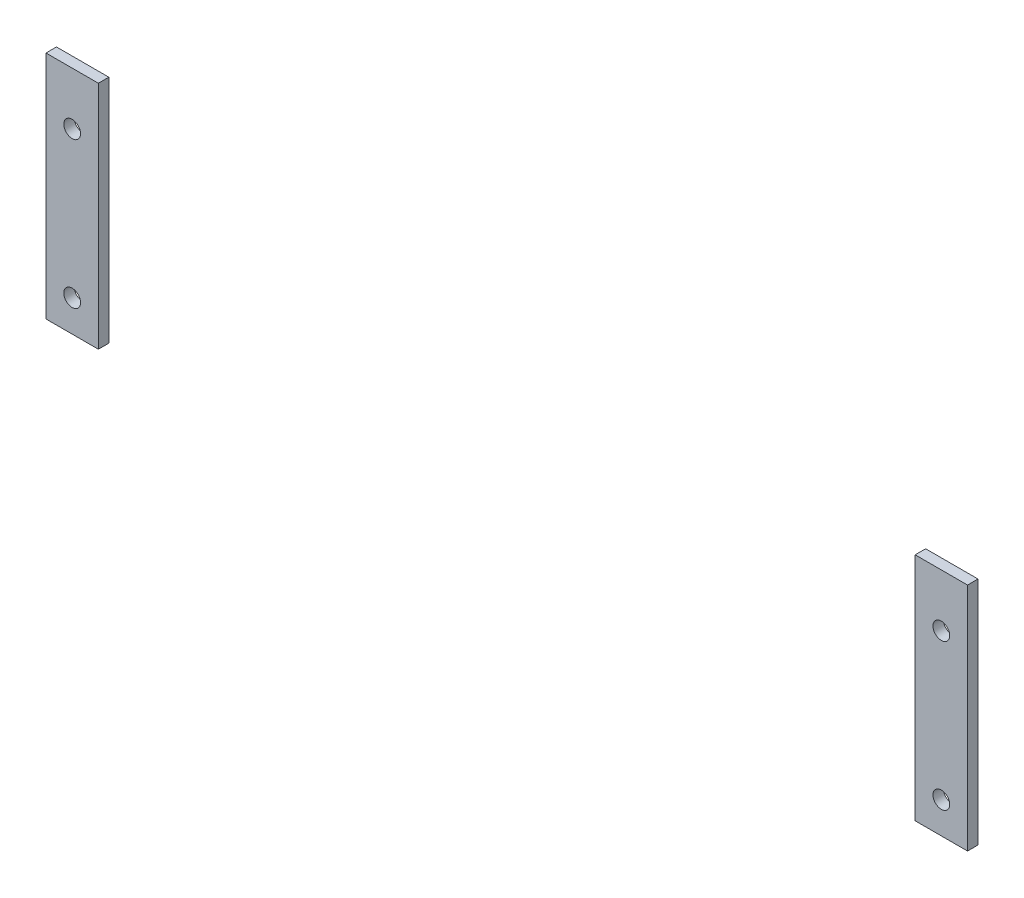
ISO-10303-21;
HEADER;
FILE_DESCRIPTION(('STEP AP214'),'2;1');
FILE_NAME('part.step','',(''),(''),'','','');
FILE_SCHEMA(('AUTOMOTIVE_DESIGN { 1 0 10303 214 1 1 1 1 }'));
ENDSEC;
DATA;
#1=APPLICATION_CONTEXT('core data for automotive mechanical design processes');
#2=APPLICATION_PROTOCOL_DEFINITION('international standard','automotive_design',2000,#1);
#3=PRODUCT_CONTEXT('',#1,'mechanical');
#4=PRODUCT('Part','Part','',(#3));
#5=PRODUCT_RELATED_PRODUCT_CATEGORY('part','',(#4));
#6=PRODUCT_DEFINITION_FORMATION('','',#4);
#7=PRODUCT_DEFINITION_CONTEXT('part definition',#1,'design');
#8=PRODUCT_DEFINITION('design','',#6,#7);
#9=PRODUCT_DEFINITION_SHAPE('','',#8);
#10=(LENGTH_UNIT() NAMED_UNIT(*) SI_UNIT(.MILLI.,.METRE.));
#11=(NAMED_UNIT(*) PLANE_ANGLE_UNIT() SI_UNIT($,.RADIAN.));
#12=(NAMED_UNIT(*) SI_UNIT($,.STERADIAN.) SOLID_ANGLE_UNIT());
#13=UNCERTAINTY_MEASURE_WITH_UNIT(LENGTH_MEASURE(1.E-05),#10,'distance_accuracy_value','');
#14=(GEOMETRIC_REPRESENTATION_CONTEXT(3) GLOBAL_UNCERTAINTY_ASSIGNED_CONTEXT((#13)) GLOBAL_UNIT_ASSIGNED_CONTEXT((#10,
#11,#12)) REPRESENTATION_CONTEXT('',''));
#15=CARTESIAN_POINT('',(0.,0.,0.));
#16=DIRECTION('',(0.,0.,1.));
#17=DIRECTION('',(1.,0.,0.));
#18=AXIS2_PLACEMENT_3D('',#15,#16,#17);
#19=CARTESIAN_POINT('',(3022.000074,-1631.829977,-1.00000000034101E-05));
#20=DIRECTION('',(1.,0.,0.));
#21=DIRECTION('',(0.,0.,-1.));
#22=AXIS2_PLACEMENT_3D('',#19,#20,#21);
#23=PLANE('',#22);
#24=DIRECTION('',(0.,1.,0.));
#25=VECTOR('',#24,1.);
#26=CARTESIAN_POINT('',(3022.000074,-1631.829977,9.99999));
#27=LINE('',#26,#25);
#28=CARTESIAN_POINT('',(3022.000074,-1631.829977,9.99999));
#29=VERTEX_POINT('',#28);
#30=CARTESIAN_POINT('',(3022.000074,-1411.829948,9.99999));
#31=VERTEX_POINT('',#30);
#32=EDGE_CURVE('E112',#29,#31,#27,.T.);
#33=ORIENTED_EDGE('',*,*,#32,.F.);
#34=DIRECTION('',(0.,0.,1.));
#35=VECTOR('',#34,1.);
#36=CARTESIAN_POINT('',(3022.000074,-1631.829977,-1.00000000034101E-05));
#37=LINE('',#36,#35);
#38=CARTESIAN_POINT('',(3022.000074,-1631.829977,-1.00000000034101E-05));
#39=VERTEX_POINT('',#38);
#40=EDGE_CURVE('E12',#39,#29,#37,.T.);
#41=ORIENTED_EDGE('',*,*,#40,.F.);
#42=DIRECTION('',(0.,1.,0.));
#43=VECTOR('',#42,1.);
#44=CARTESIAN_POINT('',(3022.000074,-1631.829977,-1.00000000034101E-05));
#45=LINE('',#44,#43);
#46=CARTESIAN_POINT('',(3022.000074,-1411.829948,-1.00000000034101E-05));
#47=VERTEX_POINT('',#46);
#48=EDGE_CURVE('E105',#39,#47,#45,.T.);
#49=ORIENTED_EDGE('',*,*,#48,.T.);
#50=DIRECTION('',(0.,0.,1.));
#51=VECTOR('',#50,1.);
#52=CARTESIAN_POINT('',(3022.000074,-1411.829948,-1.00000000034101E-05));
#53=LINE('',#52,#51);
#54=EDGE_CURVE('E50',#47,#31,#53,.T.);
#55=ORIENTED_EDGE('',*,*,#54,.T.);
#56=EDGE_LOOP('',(#33,#41,#49,#55));
#57=FACE_BOUND('',#56,.T.);
#58=ADVANCED_FACE('F47',(#57),#23,.T.);
#59=CARTESIAN_POINT('',(2972.000122,-1631.829977,-1.00000000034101E-05));
#60=DIRECTION('',(0.,-1.,0.));
#61=DIRECTION('',(0.,0.,-1.));
#62=AXIS2_PLACEMENT_3D('',#59,#60,#61);
#63=PLANE('',#62);
#64=DIRECTION('',(1.,0.,0.));
#65=VECTOR('',#64,1.);
#66=CARTESIAN_POINT('',(2972.000122,-1631.829977,9.99999));
#67=LINE('',#66,#65);
#68=CARTESIAN_POINT('',(2972.000122,-1631.829977,9.99999));
#69=VERTEX_POINT('',#68);
#70=EDGE_CURVE('E107',#69,#29,#67,.T.);
#71=ORIENTED_EDGE('',*,*,#70,.F.);
#72=DIRECTION('',(0.,0.,1.));
#73=VECTOR('',#72,1.);
#74=CARTESIAN_POINT('',(2972.000122,-1631.829977,-1.00000000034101E-05));
#75=LINE('',#74,#73);
#76=CARTESIAN_POINT('',(2972.000122,-1631.829977,-1.00000000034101E-05));
#77=VERTEX_POINT('',#76);
#78=EDGE_CURVE('E56',#77,#69,#75,.T.);
#79=ORIENTED_EDGE('',*,*,#78,.F.);
#80=DIRECTION('',(1.,0.,0.));
#81=VECTOR('',#80,1.);
#82=CARTESIAN_POINT('',(2972.000122,-1631.829977,-1.00000000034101E-05));
#83=LINE('',#82,#81);
#84=EDGE_CURVE('E102',#77,#39,#83,.T.);
#85=ORIENTED_EDGE('',*,*,#84,.T.);
#86=ORIENTED_EDGE('',*,*,#40,.T.);
#87=EDGE_LOOP('',(#71,#79,#85,#86));
#88=FACE_BOUND('',#87,.T.);
#89=ADVANCED_FACE('F123',(#88),#63,.T.);
#90=CARTESIAN_POINT('',(2972.000122,-1411.829948,-1.00000000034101E-05));
#91=DIRECTION('',(-1.,0.,0.));
#92=DIRECTION('',(0.,0.,1.));
#93=AXIS2_PLACEMENT_3D('',#90,#91,#92);
#94=PLANE('',#93);
#95=DIRECTION('',(0.,-1.,0.));
#96=VECTOR('',#95,1.);
#97=CARTESIAN_POINT('',(2972.000122,-1411.829948,9.99999));
#98=LINE('',#97,#96);
#99=CARTESIAN_POINT('',(2972.000122,-1411.829948,9.99999));
#100=VERTEX_POINT('',#99);
#101=EDGE_CURVE('E97',#100,#69,#98,.T.);
#102=ORIENTED_EDGE('',*,*,#101,.F.);
#103=DIRECTION('',(0.,0.,1.));
#104=VECTOR('',#103,1.);
#105=CARTESIAN_POINT('',(2972.000122,-1411.829948,-1.00000000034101E-05));
#106=LINE('',#105,#104);
#107=CARTESIAN_POINT('',(2972.000122,-1411.829948,-1.00000000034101E-05));
#108=VERTEX_POINT('',#107);
#109=EDGE_CURVE('E92',#108,#100,#106,.T.);
#110=ORIENTED_EDGE('',*,*,#109,.F.);
#111=DIRECTION('',(0.,-1.,0.));
#112=VECTOR('',#111,1.);
#113=CARTESIAN_POINT('',(2972.000122,-1411.829948,-1.00000000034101E-05));
#114=LINE('',#113,#112);
#115=EDGE_CURVE('E95',#108,#77,#114,.T.);
#116=ORIENTED_EDGE('',*,*,#115,.T.);
#117=ORIENTED_EDGE('',*,*,#78,.T.);
#118=EDGE_LOOP('',(#102,#110,#116,#117));
#119=FACE_BOUND('',#118,.T.);
#120=ADVANCED_FACE('F94',(#119),#94,.T.);
#121=CARTESIAN_POINT('',(3022.000074,-1411.829948,-1.00000000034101E-05));
#122=DIRECTION('',(0.,1.,0.));
#123=DIRECTION('',(0.,0.,1.));
#124=AXIS2_PLACEMENT_3D('',#121,#122,#123);
#125=PLANE('',#124);
#126=DIRECTION('',(-1.,0.,0.));
#127=VECTOR('',#126,1.);
#128=CARTESIAN_POINT('',(3022.000074,-1411.829948,9.99999));
#129=LINE('',#128,#127);
#130=EDGE_CURVE('E115',#31,#100,#129,.T.);
#131=ORIENTED_EDGE('',*,*,#130,.F.);
#132=ORIENTED_EDGE('',*,*,#54,.F.);
#133=DIRECTION('',(-1.,0.,0.));
#134=VECTOR('',#133,1.);
#135=CARTESIAN_POINT('',(3022.000074,-1411.829948,-1.00000000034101E-05));
#136=LINE('',#135,#134);
#137=EDGE_CURVE('E101',#47,#108,#136,.T.);
#138=ORIENTED_EDGE('',*,*,#137,.T.);
#139=ORIENTED_EDGE('',*,*,#109,.T.);
#140=EDGE_LOOP('',(#131,#132,#138,#139));
#141=FACE_BOUND('',#140,.T.);
#142=ADVANCED_FACE('F104',(#141),#125,.T.);
#143=CARTESIAN_POINT('',(0.,0.,-1.00000000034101E-05));
#144=DIRECTION('',(0.,0.,1.));
#145=DIRECTION('',(1.,0.,0.));
#146=AXIS2_PLACEMENT_3D('',#143,#144,#145);
#147=PLANE('',#146);
#148=CARTESIAN_POINT('',(2996.999025,-1601.830006,-1.00000000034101E-05));
#149=DIRECTION('',(0.,0.,1.));
#150=DIRECTION('',(1.,0.,0.));
#151=AXIS2_PLACEMENT_3D('',#148,#149,#150);
#152=CIRCLE('',#151,8.00000000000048);
#153=CARTESIAN_POINT('',(3004.999025,-1601.830006,-1.00000000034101E-05));
#154=VERTEX_POINT('',#153);
#155=EDGE_CURVE('E156',#154,#154,#152,.T.);
#156=ORIENTED_EDGE('',*,*,#155,.T.);
#157=EDGE_LOOP('',(#156));
#158=FACE_BOUND('',#157,.T.);
#159=CARTESIAN_POINT('',(2996.999025,-1462.159991,-1.00000000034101E-05));
#160=DIRECTION('',(0.,0.,1.));
#161=DIRECTION('',(1.,0.,0.));
#162=AXIS2_PLACEMENT_3D('',#159,#160,#161);
#163=CIRCLE('',#162,8.00000000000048);
#164=CARTESIAN_POINT('',(3004.999025,-1462.159991,-1.00000000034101E-05));
#165=VERTEX_POINT('',#164);
#166=EDGE_CURVE('E116',#165,#165,#163,.T.);
#167=ORIENTED_EDGE('',*,*,#166,.T.);
#168=EDGE_LOOP('',(#167));
#169=FACE_BOUND('',#168,.T.);
#170=ORIENTED_EDGE('',*,*,#48,.F.);
#171=ORIENTED_EDGE('',*,*,#84,.F.);
#172=ORIENTED_EDGE('',*,*,#115,.F.);
#173=ORIENTED_EDGE('',*,*,#137,.F.);
#174=EDGE_LOOP('',(#170,#171,#172,#173));
#175=FACE_BOUND('',#174,.T.);
#176=ADVANCED_FACE('F100',(#158,#169,#175),#147,.F.);
#177=CARTESIAN_POINT('',(0.,0.,9.99999));
#178=DIRECTION('',(0.,0.,1.));
#179=DIRECTION('',(1.,0.,0.));
#180=AXIS2_PLACEMENT_3D('',#177,#178,#179);
#181=PLANE('',#180);
#182=CARTESIAN_POINT('',(2996.999025,-1601.830006,9.99999));
#183=DIRECTION('',(0.,0.,1.));
#184=DIRECTION('',(1.,0.,0.));
#185=AXIS2_PLACEMENT_3D('',#182,#183,#184);
#186=CIRCLE('',#185,8.00000000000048);
#187=CARTESIAN_POINT('',(3004.999025,-1601.830006,9.99999));
#188=VERTEX_POINT('',#187);
#189=EDGE_CURVE('E159',#188,#188,#186,.T.);
#190=ORIENTED_EDGE('',*,*,#189,.F.);
#191=EDGE_LOOP('',(#190));
#192=FACE_BOUND('',#191,.T.);
#193=CARTESIAN_POINT('',(2996.999025,-1462.159991,9.99999));
#194=DIRECTION('',(0.,0.,1.));
#195=DIRECTION('',(1.,0.,0.));
#196=AXIS2_PLACEMENT_3D('',#193,#194,#195);
#197=CIRCLE('',#196,8.00000000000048);
#198=CARTESIAN_POINT('',(3004.999025,-1462.159991,9.99999));
#199=VERTEX_POINT('',#198);
#200=EDGE_CURVE('E161',#199,#199,#197,.T.);
#201=ORIENTED_EDGE('',*,*,#200,.F.);
#202=EDGE_LOOP('',(#201));
#203=FACE_BOUND('',#202,.T.);
#204=ORIENTED_EDGE('',*,*,#32,.T.);
#205=ORIENTED_EDGE('',*,*,#130,.T.);
#206=ORIENTED_EDGE('',*,*,#101,.T.);
#207=ORIENTED_EDGE('',*,*,#70,.T.);
#208=EDGE_LOOP('',(#204,#205,#206,#207));
#209=FACE_BOUND('',#208,.T.);
#210=ADVANCED_FACE('F122',(#192,#203,#209),#181,.T.);
#211=CARTESIAN_POINT('',(2996.999025,-1462.159991,-1.00000000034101E-05));
#212=DIRECTION('',(0.,0.,1.));
#213=DIRECTION('',(1.,0.,0.));
#214=AXIS2_PLACEMENT_3D('',#211,#212,#213);
#215=CYLINDRICAL_SURFACE('',#214,8.00000000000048);
#216=ORIENTED_EDGE('',*,*,#166,.F.);
#217=EDGE_LOOP('',(#216));
#218=FACE_BOUND('',#217,.T.);
#219=ORIENTED_EDGE('',*,*,#200,.T.);
#220=EDGE_LOOP('',(#219));
#221=FACE_BOUND('',#220,.T.);
#222=ADVANCED_FACE('F141',(#218,#221),#215,.F.);
#223=CARTESIAN_POINT('',(2996.999025,-1601.830006,-1.00000000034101E-05));
#224=DIRECTION('',(0.,0.,1.));
#225=DIRECTION('',(1.,0.,0.));
#226=AXIS2_PLACEMENT_3D('',#223,#224,#225);
#227=CYLINDRICAL_SURFACE('',#226,8.00000000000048);
#228=ORIENTED_EDGE('',*,*,#155,.F.);
#229=EDGE_LOOP('',(#228));
#230=FACE_BOUND('',#229,.T.);
#231=ORIENTED_EDGE('',*,*,#189,.T.);
#232=EDGE_LOOP('',(#231));
#233=FACE_BOUND('',#232,.T.);
#234=ADVANCED_FACE('F148',(#230,#233),#227,.F.);
#235=CLOSED_SHELL('',(#58,#89,#120,#142,#176,#210,#222,#234));
#236=MANIFOLD_SOLID_BREP('B2',#235);
#237=CARTESIAN_POINT('',(2191.999912,-1631.829977,-1.00000000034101E-05));
#238=DIRECTION('',(1.,0.,0.));
#239=DIRECTION('',(0.,0.,-1.));
#240=AXIS2_PLACEMENT_3D('',#237,#238,#239);
#241=PLANE('',#240);
#242=DIRECTION('',(0.,1.,0.));
#243=VECTOR('',#242,1.);
#244=CARTESIAN_POINT('',(2191.999912,-1631.829977,9.99999));
#245=LINE('',#244,#243);
#246=CARTESIAN_POINT('',(2191.999912,-1631.829977,9.99999));
#247=VERTEX_POINT('',#246);
#248=CARTESIAN_POINT('',(2191.999912,-1411.829948,9.99999));
#249=VERTEX_POINT('',#248);
#250=EDGE_CURVE('E278',#247,#249,#245,.T.);
#251=ORIENTED_EDGE('',*,*,#250,.F.);
#252=DIRECTION('',(0.,0.,1.));
#253=VECTOR('',#252,1.);
#254=CARTESIAN_POINT('',(2191.999912,-1631.829977,-1.00000000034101E-05));
#255=LINE('',#254,#253);
#256=CARTESIAN_POINT('',(2191.999912,-1631.829977,-1.00000000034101E-05));
#257=VERTEX_POINT('',#256);
#258=EDGE_CURVE('E45',#257,#247,#255,.T.);
#259=ORIENTED_EDGE('',*,*,#258,.F.);
#260=DIRECTION('',(0.,1.,0.));
#261=VECTOR('',#260,1.);
#262=CARTESIAN_POINT('',(2191.999912,-1631.829977,-1.00000000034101E-05));
#263=LINE('',#262,#261);
#264=CARTESIAN_POINT('',(2191.999912,-1411.829948,-1.00000000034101E-05));
#265=VERTEX_POINT('',#264);
#266=EDGE_CURVE('E271',#257,#265,#263,.T.);
#267=ORIENTED_EDGE('',*,*,#266,.T.);
#268=DIRECTION('',(0.,0.,1.));
#269=VECTOR('',#268,1.);
#270=CARTESIAN_POINT('',(2191.999912,-1411.829948,-1.00000000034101E-05));
#271=LINE('',#270,#269);
#272=EDGE_CURVE('E216',#265,#249,#271,.T.);
#273=ORIENTED_EDGE('',*,*,#272,.T.);
#274=EDGE_LOOP('',(#251,#259,#267,#273));
#275=FACE_BOUND('',#274,.T.);
#276=ADVANCED_FACE('F213',(#275),#241,.T.);
#277=CARTESIAN_POINT('',(2141.99996,-1631.829977,-1.00000000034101E-05));
#278=DIRECTION('',(0.,-1.,0.));
#279=DIRECTION('',(0.,0.,-1.));
#280=AXIS2_PLACEMENT_3D('',#277,#278,#279);
#281=PLANE('',#280);
#282=DIRECTION('',(1.,0.,0.));
#283=VECTOR('',#282,1.);
#284=CARTESIAN_POINT('',(2141.99996,-1631.829977,9.99999));
#285=LINE('',#284,#283);
#286=CARTESIAN_POINT('',(2141.99996,-1631.829977,9.99999));
#287=VERTEX_POINT('',#286);
#288=EDGE_CURVE('E273',#287,#247,#285,.T.);
#289=ORIENTED_EDGE('',*,*,#288,.F.);
#290=DIRECTION('',(0.,0.,1.));
#291=VECTOR('',#290,1.);
#292=CARTESIAN_POINT('',(2141.99996,-1631.829977,-1.00000000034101E-05));
#293=LINE('',#292,#291);
#294=CARTESIAN_POINT('',(2141.99996,-1631.829977,-1.00000000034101E-05));
#295=VERTEX_POINT('',#294);
#296=EDGE_CURVE('E222',#295,#287,#293,.T.);
#297=ORIENTED_EDGE('',*,*,#296,.F.);
#298=DIRECTION('',(1.,0.,0.));
#299=VECTOR('',#298,1.);
#300=CARTESIAN_POINT('',(2141.99996,-1631.829977,-1.00000000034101E-05));
#301=LINE('',#300,#299);
#302=EDGE_CURVE('E268',#295,#257,#301,.T.);
#303=ORIENTED_EDGE('',*,*,#302,.T.);
#304=ORIENTED_EDGE('',*,*,#258,.T.);
#305=EDGE_LOOP('',(#289,#297,#303,#304));
#306=FACE_BOUND('',#305,.T.);
#307=ADVANCED_FACE('F289',(#306),#281,.T.);
#308=CARTESIAN_POINT('',(2141.99996,-1411.829948,-1.00000000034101E-05));
#309=DIRECTION('',(-1.,0.,0.));
#310=DIRECTION('',(0.,0.,1.));
#311=AXIS2_PLACEMENT_3D('',#308,#309,#310);
#312=PLANE('',#311);
#313=DIRECTION('',(0.,-1.,0.));
#314=VECTOR('',#313,1.);
#315=CARTESIAN_POINT('',(2141.99996,-1411.829948,9.99999));
#316=LINE('',#315,#314);
#317=CARTESIAN_POINT('',(2141.99996,-1411.829948,9.99999));
#318=VERTEX_POINT('',#317);
#319=EDGE_CURVE('E263',#318,#287,#316,.T.);
#320=ORIENTED_EDGE('',*,*,#319,.F.);
#321=DIRECTION('',(0.,0.,1.));
#322=VECTOR('',#321,1.);
#323=CARTESIAN_POINT('',(2141.99996,-1411.829948,-1.00000000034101E-05));
#324=LINE('',#323,#322);
#325=CARTESIAN_POINT('',(2141.99996,-1411.829948,-1.00000000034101E-05));
#326=VERTEX_POINT('',#325);
#327=EDGE_CURVE('E258',#326,#318,#324,.T.);
#328=ORIENTED_EDGE('',*,*,#327,.F.);
#329=DIRECTION('',(0.,-1.,0.));
#330=VECTOR('',#329,1.);
#331=CARTESIAN_POINT('',(2141.99996,-1411.829948,-1.00000000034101E-05));
#332=LINE('',#331,#330);
#333=EDGE_CURVE('E261',#326,#295,#332,.T.);
#334=ORIENTED_EDGE('',*,*,#333,.T.);
#335=ORIENTED_EDGE('',*,*,#296,.T.);
#336=EDGE_LOOP('',(#320,#328,#334,#335));
#337=FACE_BOUND('',#336,.T.);
#338=ADVANCED_FACE('F260',(#337),#312,.T.);
#339=CARTESIAN_POINT('',(2191.999912,-1411.829948,-1.00000000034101E-05));
#340=DIRECTION('',(0.,1.,0.));
#341=DIRECTION('',(0.,0.,1.));
#342=AXIS2_PLACEMENT_3D('',#339,#340,#341);
#343=PLANE('',#342);
#344=DIRECTION('',(-1.,0.,0.));
#345=VECTOR('',#344,1.);
#346=CARTESIAN_POINT('',(2191.999912,-1411.829948,9.99999));
#347=LINE('',#346,#345);
#348=EDGE_CURVE('E281',#249,#318,#347,.T.);
#349=ORIENTED_EDGE('',*,*,#348,.F.);
#350=ORIENTED_EDGE('',*,*,#272,.F.);
#351=DIRECTION('',(-1.,0.,0.));
#352=VECTOR('',#351,1.);
#353=CARTESIAN_POINT('',(2191.999912,-1411.829948,-1.00000000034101E-05));
#354=LINE('',#353,#352);
#355=EDGE_CURVE('E267',#265,#326,#354,.T.);
#356=ORIENTED_EDGE('',*,*,#355,.T.);
#357=ORIENTED_EDGE('',*,*,#327,.T.);
#358=EDGE_LOOP('',(#349,#350,#356,#357));
#359=FACE_BOUND('',#358,.T.);
#360=ADVANCED_FACE('F270',(#359),#343,.T.);
#361=CARTESIAN_POINT('',(0.,0.,-1.00000000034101E-05));
#362=DIRECTION('',(0.,0.,1.));
#363=DIRECTION('',(1.,0.,0.));
#364=AXIS2_PLACEMENT_3D('',#361,#362,#363);
#365=PLANE('',#364);
#366=CARTESIAN_POINT('',(2167.000055,-1462.159991,-1.00000000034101E-05));
#367=DIRECTION('',(0.,0.,1.));
#368=DIRECTION('',(1.,0.,0.));
#369=AXIS2_PLACEMENT_3D('',#366,#367,#368);
#370=CIRCLE('',#369,8.00000000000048);
#371=CARTESIAN_POINT('',(2175.000055,-1462.159991,-1.00000000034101E-05));
#372=VERTEX_POINT('',#371);
#373=EDGE_CURVE('E322',#372,#372,#370,.T.);
#374=ORIENTED_EDGE('',*,*,#373,.T.);
#375=EDGE_LOOP('',(#374));
#376=FACE_BOUND('',#375,.T.);
#377=CARTESIAN_POINT('',(2167.000055,-1601.830006,-1.00000000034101E-05));
#378=DIRECTION('',(0.,0.,1.));
#379=DIRECTION('',(1.,0.,0.));
#380=AXIS2_PLACEMENT_3D('',#377,#378,#379);
#381=CIRCLE('',#380,8.00000000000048);
#382=CARTESIAN_POINT('',(2175.000055,-1601.830006,-1.00000000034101E-05));
#383=VERTEX_POINT('',#382);
#384=EDGE_CURVE('E282',#383,#383,#381,.T.);
#385=ORIENTED_EDGE('',*,*,#384,.T.);
#386=EDGE_LOOP('',(#385));
#387=FACE_BOUND('',#386,.T.);
#388=ORIENTED_EDGE('',*,*,#266,.F.);
#389=ORIENTED_EDGE('',*,*,#302,.F.);
#390=ORIENTED_EDGE('',*,*,#333,.F.);
#391=ORIENTED_EDGE('',*,*,#355,.F.);
#392=EDGE_LOOP('',(#388,#389,#390,#391));
#393=FACE_BOUND('',#392,.T.);
#394=ADVANCED_FACE('F266',(#376,#387,#393),#365,.F.);
#395=CARTESIAN_POINT('',(0.,0.,9.99999));
#396=DIRECTION('',(0.,0.,1.));
#397=DIRECTION('',(1.,0.,0.));
#398=AXIS2_PLACEMENT_3D('',#395,#396,#397);
#399=PLANE('',#398);
#400=CARTESIAN_POINT('',(2167.000055,-1462.159991,9.99999));
#401=DIRECTION('',(0.,0.,1.));
#402=DIRECTION('',(1.,0.,0.));
#403=AXIS2_PLACEMENT_3D('',#400,#401,#402);
#404=CIRCLE('',#403,8.00000000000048);
#405=CARTESIAN_POINT('',(2175.000055,-1462.159991,9.99999));
#406=VERTEX_POINT('',#405);
#407=EDGE_CURVE('E325',#406,#406,#404,.T.);
#408=ORIENTED_EDGE('',*,*,#407,.F.);
#409=EDGE_LOOP('',(#408));
#410=FACE_BOUND('',#409,.T.);
#411=CARTESIAN_POINT('',(2167.000055,-1601.830006,9.99999));
#412=DIRECTION('',(0.,0.,1.));
#413=DIRECTION('',(1.,0.,0.));
#414=AXIS2_PLACEMENT_3D('',#411,#412,#413);
#415=CIRCLE('',#414,8.00000000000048);
#416=CARTESIAN_POINT('',(2175.000055,-1601.830006,9.99999));
#417=VERTEX_POINT('',#416);
#418=EDGE_CURVE('E327',#417,#417,#415,.T.);
#419=ORIENTED_EDGE('',*,*,#418,.F.);
#420=EDGE_LOOP('',(#419));
#421=FACE_BOUND('',#420,.T.);
#422=ORIENTED_EDGE('',*,*,#250,.T.);
#423=ORIENTED_EDGE('',*,*,#348,.T.);
#424=ORIENTED_EDGE('',*,*,#319,.T.);
#425=ORIENTED_EDGE('',*,*,#288,.T.);
#426=EDGE_LOOP('',(#422,#423,#424,#425));
#427=FACE_BOUND('',#426,.T.);
#428=ADVANCED_FACE('F288',(#410,#421,#427),#399,.T.);
#429=CARTESIAN_POINT('',(2167.000055,-1601.830006,-1.00000000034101E-05));
#430=DIRECTION('',(0.,0.,1.));
#431=DIRECTION('',(1.,0.,0.));
#432=AXIS2_PLACEMENT_3D('',#429,#430,#431);
#433=CYLINDRICAL_SURFACE('',#432,8.00000000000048);
#434=ORIENTED_EDGE('',*,*,#384,.F.);
#435=EDGE_LOOP('',(#434));
#436=FACE_BOUND('',#435,.T.);
#437=ORIENTED_EDGE('',*,*,#418,.T.);
#438=EDGE_LOOP('',(#437));
#439=FACE_BOUND('',#438,.T.);
#440=ADVANCED_FACE('F307',(#436,#439),#433,.F.);
#441=CARTESIAN_POINT('',(2167.000055,-1462.159991,-1.00000000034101E-05));
#442=DIRECTION('',(0.,0.,1.));
#443=DIRECTION('',(1.,0.,0.));
#444=AXIS2_PLACEMENT_3D('',#441,#442,#443);
#445=CYLINDRICAL_SURFACE('',#444,8.00000000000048);
#446=ORIENTED_EDGE('',*,*,#373,.F.);
#447=EDGE_LOOP('',(#446));
#448=FACE_BOUND('',#447,.T.);
#449=ORIENTED_EDGE('',*,*,#407,.T.);
#450=EDGE_LOOP('',(#449));
#451=FACE_BOUND('',#450,.T.);
#452=ADVANCED_FACE('F314',(#448,#451),#445,.F.);
#453=CLOSED_SHELL('',(#276,#307,#338,#360,#394,#428,#440,#452));
#454=MANIFOLD_SOLID_BREP('B6',#453);
#455=ADVANCED_BREP_SHAPE_REPRESENTATION('',(#18,#236,#454),#14);
#456=SHAPE_DEFINITION_REPRESENTATION(#9,#455);
ENDSEC;
END-ISO-10303-21;
